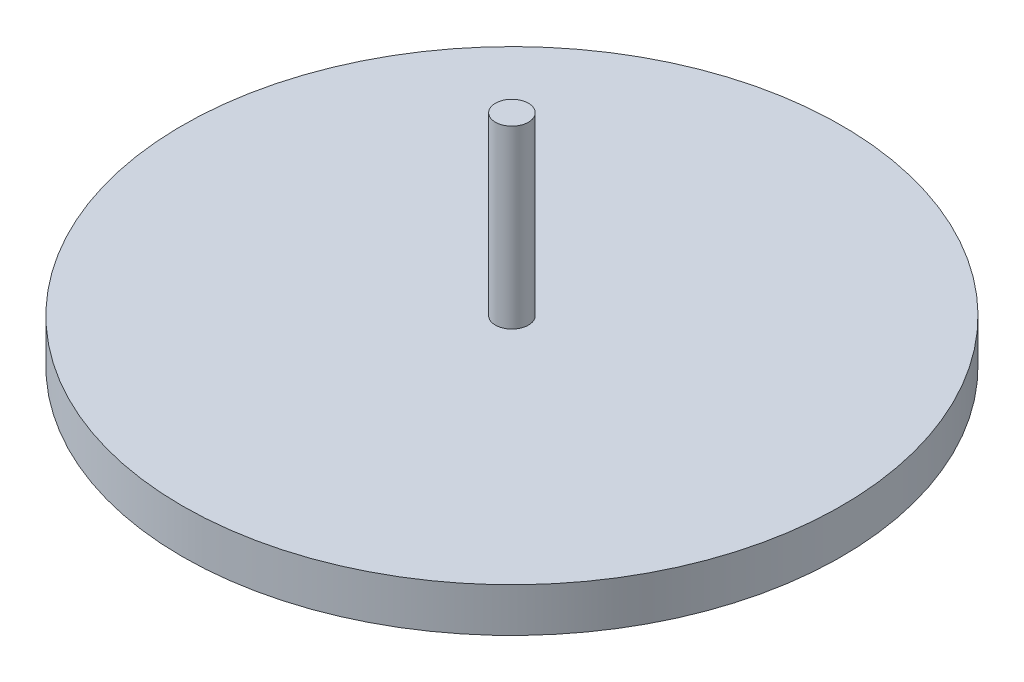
from build123d import *

# Parameters (mm, degrees)
CROQUIS1_R              = 150
SALIENTE_EXTRUIR1_DEPTH = 20
CROQUIS2_R              = 7.5
SALIENTE_EXTRUIR2_DEPTH = 80


with BuildPart() as part:
    # Croquis1 → Saliente-Extruir1 (new body)
    with BuildSketch(Plane(origin=(0, 0, 0), x_dir=(1, 0, 0), z_dir=(0, 1, 0))):
        with Locations(Location((0, 0, 0), (0, 0, 270))):
            Circle(CROQUIS1_R)
    extrude(amount=SALIENTE_EXTRUIR1_DEPTH)


with BuildPart() as body_2:
    # Croquis2 → Saliente-Extruir2 (new body)
    with BuildSketch(Plane(origin=(0, 20, 0), x_dir=(1, 0, 0), z_dir=(0, 1, 0))):
        with Locations(Location((0, 0, 0), (0, 0, 270))):
            Circle(CROQUIS2_R)
    extrude(amount=SALIENTE_EXTRUIR2_DEPTH)


solid = Compound([part.part, body_2.part])
